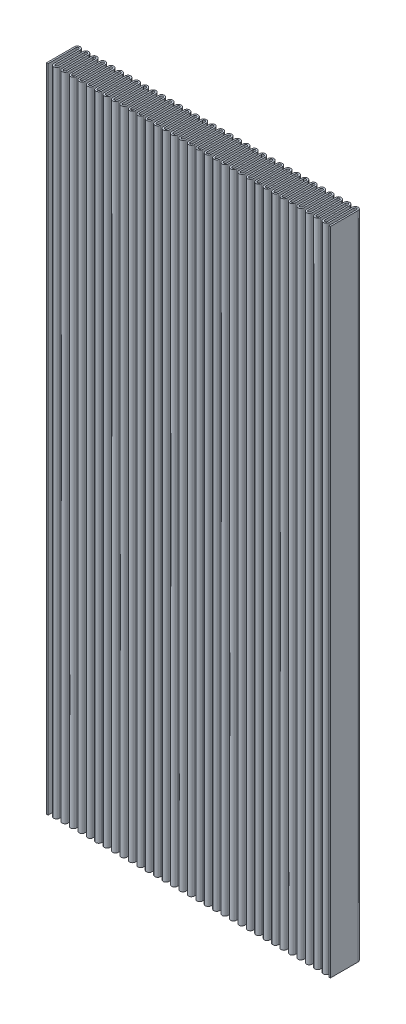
from build123d import *

# Parameters (mm, degrees)
BOSS_EXTRUDE1_DEPTH = 85


with BuildPart() as part:
    # Sketch1 → Boss-Extrude1 (new body)
    with BuildSketch(Plane(origin=(0, 0, 0), x_dir=(1, 0, 0), z_dir=(0, 1, 0))):
        with BuildLine():
            ThreePointArc((0, 3.8), (0.123743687, 3.748743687), (0.175, 3.625))
            Line((0.175, 3.625), (0.175, 0.375))
            ThreePointArc((0.175, 0.375), (0.284834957, 0.109834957), (0.55, 0))
            Line((0.55, 0), (0.55, 0.2))
            ThreePointArc((0.55, 0.2), (0.426256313, 0.251256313), (0.375, 0.375))
            Line((0.375, 0.375), (0.375, 3.625))
            ThreePointArc((0.375, 3.625), (0.265165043, 3.890165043), (0, 4))
            Line((0, 4), (0, 3.8))
        make_face()
        with BuildLine():
            ThreePointArc((-0.175, 3.625), (-0.123743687, 3.748743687), (0, 3.8))
            Line((0, 3.8), (0, 4))
            ThreePointArc((0, 4), (-0.265165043, 3.890165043), (-0.375, 3.625))
            Line((-0.375, 3.625), (-0.375, 0.375))
            Line((-0.375, 0.375), (-0.375, 0))
            Line((-0.375, 0), (-0.175, 0))
            Line((-0.175, 0), (-0.175, 0.375))
            Line((-0.175, 0.375), (-0.175, 3.625))
        make_face()
        with BuildLine():
            Line((0.55, 0.2), (0.55, 0))
            ThreePointArc((0.55, 0), (0.815165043, 0.109834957), (0.925, 0.375))
            Line((0.925, 0.375), (0.925, 3.625))
            ThreePointArc((0.925, 3.625), (0.976256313, 3.748743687), (1.1, 3.8))
            ThreePointArc((1.1, 3.8), (1.223743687, 3.748743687), (1.275, 3.625))
            Line((1.275, 3.625), (1.275, 0.375))
            ThreePointArc((1.275, 0.375), (1.65, 0), (2.025, 0.375))
            Line((2.025, 0.375), (2.025, 3.625))
            ThreePointArc((2.025, 3.625), (2.076256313, 3.748743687), (2.2, 3.8))
            ThreePointArc((2.2, 3.8), (2.323743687, 3.748743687), (2.375, 3.625))
            Line((2.375, 3.625), (2.375, 0.375))
            ThreePointArc((2.375, 0.375), (2.75, 0), (3.125, 0.375))
            Line((3.125, 0.375), (3.125, 3.625))
            ThreePointArc((3.125, 3.625), (3.176256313, 3.748743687), (3.3, 3.8))
            ThreePointArc((3.3, 3.8), (3.423743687, 3.748743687), (3.475, 3.625))
            Line((3.475, 3.625), (3.475, 0.375))
            ThreePointArc((3.475, 0.375), (3.85, 0), (4.225, 0.375))
            Line((4.225, 0.375), (4.225, 3.625))
            ThreePointArc((4.225, 3.625), (4.276256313, 3.748743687), (4.4, 3.8))
            ThreePointArc((4.4, 3.8), (4.523743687, 3.748743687), (4.575, 3.625))
            Line((4.575, 3.625), (4.575, 0.375))
            ThreePointArc((4.575, 0.375), (4.95, 0), (5.325, 0.375))
            Line((5.325, 0.375), (5.325, 3.625))
            ThreePointArc((5.325, 3.625), (5.376256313, 3.748743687), (5.5, 3.8))
            ThreePointArc((5.5, 3.8), (5.623743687, 3.748743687), (5.675, 3.625))
            Line((5.675, 3.625), (5.675, 0.375))
            ThreePointArc((5.675, 0.375), (6.05, 0), (6.425, 0.375))
            Line((6.425, 0.375), (6.425, 3.625))
            ThreePointArc((6.425, 3.625), (6.476256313, 3.748743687), (6.6, 3.8))
            ThreePointArc((6.6, 3.8), (6.723743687, 3.748743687), (6.775, 3.625))
            Line((6.775, 3.625), (6.775, 0.375))
            ThreePointArc((6.775, 0.375), (7.15, 0), (7.525, 0.375))
            Line((7.525, 0.375), (7.525, 3.625))
            ThreePointArc((7.525, 3.625), (7.576256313, 3.748743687), (7.7, 3.8))
            ThreePointArc((7.7, 3.8), (7.823743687, 3.748743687), (7.875, 3.625))
            Line((7.875, 3.625), (7.875, 0.375))
            ThreePointArc((7.875, 0.375), (8.25, 0), (8.625, 0.375))
            Line((8.625, 0.375), (8.625, 3.625))
            ThreePointArc((8.625, 3.625), (8.676256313, 3.748743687), (8.8, 3.8))
            ThreePointArc((8.8, 3.8), (8.923743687, 3.748743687), (8.975, 3.625))
            Line((8.975, 3.625), (8.975, 0.375))
            ThreePointArc((8.975, 0.375), (9.35, 0), (9.725, 0.375))
            Line((9.725, 0.375), (9.725, 3.625))
            ThreePointArc((9.725, 3.625), (9.776256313, 3.748743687), (9.9, 3.8))
            ThreePointArc((9.9, 3.8), (10.023743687, 3.748743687), (10.075, 3.625))
            Line((10.075, 3.625), (10.075, 0.375))
            ThreePointArc((10.075, 0.375), (10.45, 0), (10.825, 0.375))
            Line((10.825, 0.375), (10.825, 3.625))
            ThreePointArc((10.825, 3.625), (10.876256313, 3.748743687), (11, 3.8))
            ThreePointArc((11, 3.8), (11.123743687, 3.748743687), (11.175, 3.625))
            Line((11.175, 3.625), (11.175, 0.375))
            ThreePointArc((11.175, 0.375), (11.55, 0), (11.925, 0.375))
            Line((11.925, 0.375), (11.925, 3.625))
            ThreePointArc((11.925, 3.625), (11.976256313, 3.748743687), (12.1, 3.8))
            ThreePointArc((12.1, 3.8), (12.223743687, 3.748743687), (12.275, 3.625))
            Line((12.275, 3.625), (12.275, 0.375))
            ThreePointArc((12.275, 0.375), (12.65, 0), (13.025, 0.375))
            Line((13.025, 0.375), (13.025, 3.625))
            ThreePointArc((13.025, 3.625), (13.076256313, 3.748743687), (13.2, 3.8))
            ThreePointArc((13.2, 3.8), (13.323743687, 3.748743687), (13.375, 3.625))
            Line((13.375, 3.625), (13.375, 0.375))
            ThreePointArc((13.375, 0.375), (13.75, 0), (14.125, 0.375))
            Line((14.125, 0.375), (14.125, 3.625))
            ThreePointArc((14.125, 3.625), (14.176256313, 3.748743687), (14.3, 3.8))
            ThreePointArc((14.3, 3.8), (14.423743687, 3.748743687), (14.475, 3.625))
            Line((14.475, 3.625), (14.475, 0.375))
            ThreePointArc((14.475, 0.375), (14.85, 0), (15.225, 0.375))
            Line((15.225, 0.375), (15.225, 3.625))
            ThreePointArc((15.225, 3.625), (15.276256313, 3.748743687), (15.4, 3.8))
            ThreePointArc((15.4, 3.8), (15.523743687, 3.748743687), (15.575, 3.625))
            Line((15.575, 3.625), (15.575, 0.375))
            ThreePointArc((15.575, 0.375), (15.95, 0), (16.325, 0.375))
            Line((16.325, 0.375), (16.325, 3.625))
            ThreePointArc((16.325, 3.625), (16.376256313, 3.748743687), (16.5, 3.8))
            ThreePointArc((16.5, 3.8), (16.623743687, 3.748743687), (16.675, 3.625))
            Line((16.675, 3.625), (16.675, 0.375))
            ThreePointArc((16.675, 0.375), (17.05, 0), (17.425, 0.375))
            Line((17.425, 0.375), (17.425, 3.625))
            ThreePointArc((17.425, 3.625), (17.476256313, 3.748743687), (17.6, 3.8))
            ThreePointArc((17.6, 3.8), (17.723743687, 3.748743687), (17.775, 3.625))
            Line((17.775, 3.625), (17.775, 0.375))
            ThreePointArc((17.775, 0.375), (18.15, 0), (18.525, 0.375))
            Line((18.525, 0.375), (18.525, 3.625))
            ThreePointArc((18.525, 3.625), (18.576256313, 3.748743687), (18.7, 3.8))
            ThreePointArc((18.7, 3.8), (18.823743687, 3.748743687), (18.875, 3.625))
            Line((18.875, 3.625), (18.875, 0.375))
            ThreePointArc((18.875, 0.375), (19.25, 0), (19.625, 0.375))
            Line((19.625, 0.375), (19.625, 3.625))
            ThreePointArc((19.625, 3.625), (19.676256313, 3.748743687), (19.8, 3.8))
            ThreePointArc((19.8, 3.8), (19.923743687, 3.748743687), (19.975, 3.625))
            Line((19.975, 3.625), (19.975, 0.375))
            ThreePointArc((19.975, 0.375), (20.35, 0), (20.725, 0.375))
            Line((20.725, 0.375), (20.725, 3.625))
            ThreePointArc((20.725, 3.625), (20.776256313, 3.748743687), (20.9, 3.8))
            ThreePointArc((20.9, 3.8), (21.023743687, 3.748743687), (21.075, 3.625))
            Line((21.075, 3.625), (21.075, 0.375))
            ThreePointArc((21.075, 0.375), (21.45, 0), (21.825, 0.375))
            Line((21.825, 0.375), (21.825, 3.625))
            ThreePointArc((21.825, 3.625), (21.876256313, 3.748743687), (22, 3.8))
            ThreePointArc((22, 3.8), (22.123743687, 3.748743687), (22.175, 3.625))
            Line((22.175, 3.625), (22.175, 0.375))
            ThreePointArc((22.175, 0.375), (22.55, 0), (22.925, 0.375))
            Line((22.925, 0.375), (22.925, 3.625))
            ThreePointArc((22.925, 3.625), (22.976256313, 3.748743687), (23.1, 3.8))
            ThreePointArc((23.1, 3.8), (23.223743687, 3.748743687), (23.275, 3.625))
            Line((23.275, 3.625), (23.275, 0.375))
            ThreePointArc((23.275, 0.375), (23.65, 0), (24.025, 0.375))
            Line((24.025, 0.375), (24.025, 3.625))
            ThreePointArc((24.025, 3.625), (24.076256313, 3.748743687), (24.2, 3.8))
            ThreePointArc((24.2, 3.8), (24.323743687, 3.748743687), (24.375, 3.625))
            Line((24.375, 3.625), (24.375, 0.375))
            ThreePointArc((24.375, 0.375), (24.75, 0), (25.125, 0.375))
            Line((25.125, 0.375), (25.125, 3.625))
            ThreePointArc((25.125, 3.625), (25.176256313, 3.748743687), (25.3, 3.8))
            ThreePointArc((25.3, 3.8), (25.423743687, 3.748743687), (25.475, 3.625))
            Line((25.475, 3.625), (25.475, 0.375))
            ThreePointArc((25.475, 0.375), (25.85, 0), (26.225, 0.375))
            Line((26.225, 0.375), (26.225, 3.625))
            ThreePointArc((26.225, 3.625), (26.276256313, 3.748743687), (26.4, 3.8))
            ThreePointArc((26.4, 3.8), (26.523743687, 3.748743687), (26.575, 3.625))
            Line((26.575, 3.625), (26.575, 0.375))
            ThreePointArc((26.575, 0.375), (26.95, 0), (27.325, 0.375))
            Line((27.325, 0.375), (27.325, 3.625))
            ThreePointArc((27.325, 3.625), (27.376256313, 3.748743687), (27.5, 3.8))
            ThreePointArc((27.5, 3.8), (27.623743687, 3.748743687), (27.675, 3.625))
            Line((27.675, 3.625), (27.675, 0.375))
            ThreePointArc((27.675, 0.375), (28.05, 0), (28.425, 0.375))
            Line((28.425, 0.375), (28.425, 3.625))
            ThreePointArc((28.425, 3.625), (28.476256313, 3.748743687), (28.6, 3.8))
            ThreePointArc((28.6, 3.8), (28.723743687, 3.748743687), (28.775, 3.625))
            Line((28.775, 3.625), (28.775, 0.375))
            ThreePointArc((28.775, 0.375), (29.15, 0), (29.525, 0.375))
            Line((29.525, 0.375), (29.525, 3.625))
            ThreePointArc((29.525, 3.625), (29.576256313, 3.748743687), (29.7, 3.8))
            ThreePointArc((29.7, 3.8), (29.823743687, 3.748743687), (29.875, 3.625))
            Line((29.875, 3.625), (29.875, 0.375))
            ThreePointArc((29.875, 0.375), (30.25, 0), (30.625, 0.375))
            Line((30.625, 0.375), (30.625, 3.625))
            ThreePointArc((30.625, 3.625), (30.676256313, 3.748743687), (30.8, 3.8))
            ThreePointArc((30.8, 3.8), (30.923743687, 3.748743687), (30.975, 3.625))
            Line((30.975, 3.625), (30.975, 0.375))
            ThreePointArc((30.975, 0.375), (31.35, 0), (31.725, 0.375))
            Line((31.725, 0.375), (31.725, 3.625))
            ThreePointArc((31.725, 3.625), (31.776256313, 3.748743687), (31.9, 3.8))
            ThreePointArc((31.9, 3.8), (32.023743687, 3.748743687), (32.075, 3.625))
            Line((32.075, 3.625), (32.075, 0.375))
            ThreePointArc((32.075, 0.375), (32.45, 0), (32.825, 0.375))
            Line((32.825, 0.375), (32.825, 3.625))
            ThreePointArc((32.825, 3.625), (32.876256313, 3.748743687), (33, 3.8))
            ThreePointArc((33, 3.8), (33.123743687, 3.748743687), (33.175, 3.625))
            Line((33.175, 3.625), (33.175, 0.375))
            ThreePointArc((33.175, 0.375), (33.55, 0), (33.925, 0.375))
            Line((33.925, 0.375), (33.925, 3.625))
            ThreePointArc((33.925, 3.625), (33.976256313, 3.748743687), (34.1, 3.8))
            ThreePointArc((34.1, 3.8), (34.223743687, 3.748743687), (34.275, 3.625))
            Line((34.275, 3.625), (34.275, 0.375))
            ThreePointArc((34.275, 0.375), (34.65, 0), (35.025, 0.375))
            Line((35.025, 0.375), (35.025, 3.625))
            ThreePointArc((35.025, 3.625), (35.076256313, 3.748743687), (35.2, 3.8))
            ThreePointArc((35.2, 3.8), (35.323743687, 3.748743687), (35.375, 3.625))
            Line((35.375, 3.625), (35.375, 0.375))
            ThreePointArc((35.375, 0.375), (35.75, 0), (36.125, 0.375))
            Line((36.125, 0.375), (36.125, 3.625))
            ThreePointArc((36.125, 3.625), (36.176256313, 3.748743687), (36.3, 3.8))
            ThreePointArc((36.3, 3.8), (36.423743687, 3.748743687), (36.475, 3.625))
            Line((36.475, 3.625), (36.475, 0))
            Line((36.475, 0), (36.675, 0))
            Line((36.675, 0), (36.675, 3.625))
            ThreePointArc((36.675, 3.625), (36.565165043, 3.890165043), (36.3, 4))
            ThreePointArc((36.3, 4), (36.034834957, 3.890165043), (35.925, 3.625))
            Line((35.925, 3.625), (35.925, 0.375))
            ThreePointArc((35.925, 0.375), (35.75, 0.2), (35.575, 0.375))
            Line((35.575, 0.375), (35.575, 3.625))
            ThreePointArc((35.575, 3.625), (35.465165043, 3.890165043), (35.2, 4))
            ThreePointArc((35.2, 4), (34.934834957, 3.890165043), (34.825, 3.625))
            Line((34.825, 3.625), (34.825, 0.375))
            ThreePointArc((34.825, 0.375), (34.65, 0.2), (34.475, 0.375))
            Line((34.475, 0.375), (34.475, 3.625))
            ThreePointArc((34.475, 3.625), (34.365165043, 3.890165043), (34.1, 4))
            ThreePointArc((34.1, 4), (33.834834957, 3.890165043), (33.725, 3.625))
            Line((33.725, 3.625), (33.725, 0.375))
            ThreePointArc((33.725, 0.375), (33.55, 0.2), (33.375, 0.375))
            Line((33.375, 0.375), (33.375, 3.625))
            ThreePointArc((33.375, 3.625), (33.265165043, 3.890165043), (33, 4))
            ThreePointArc((33, 4), (32.734834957, 3.890165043), (32.625, 3.625))
            Line((32.625, 3.625), (32.625, 0.375))
            ThreePointArc((32.625, 0.375), (32.45, 0.2), (32.275, 0.375))
            Line((32.275, 0.375), (32.275, 3.625))
            ThreePointArc((32.275, 3.625), (32.165165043, 3.890165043), (31.9, 4))
            ThreePointArc((31.9, 4), (31.634834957, 3.890165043), (31.525, 3.625))
            Line((31.525, 3.625), (31.525, 0.375))
            ThreePointArc((31.525, 0.375), (31.35, 0.2), (31.175, 0.375))
            Line((31.175, 0.375), (31.175, 3.625))
            ThreePointArc((31.175, 3.625), (31.065165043, 3.890165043), (30.8, 4))
            ThreePointArc((30.8, 4), (30.534834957, 3.890165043), (30.425, 3.625))
            Line((30.425, 3.625), (30.425, 0.375))
            ThreePointArc((30.425, 0.375), (30.25, 0.2), (30.075, 0.375))
            Line((30.075, 0.375), (30.075, 3.625))
            ThreePointArc((30.075, 3.625), (29.965165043, 3.890165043), (29.7, 4))
            ThreePointArc((29.7, 4), (29.434834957, 3.890165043), (29.325, 3.625))
            Line((29.325, 3.625), (29.325, 0.375))
            ThreePointArc((29.325, 0.375), (29.15, 0.2), (28.975, 0.375))
            Line((28.975, 0.375), (28.975, 3.625))
            ThreePointArc((28.975, 3.625), (28.865165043, 3.890165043), (28.6, 4))
            ThreePointArc((28.6, 4), (28.334834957, 3.890165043), (28.225, 3.625))
            Line((28.225, 3.625), (28.225, 0.375))
            ThreePointArc((28.225, 0.375), (28.05, 0.2), (27.875, 0.375))
            Line((27.875, 0.375), (27.875, 3.625))
            ThreePointArc((27.875, 3.625), (27.765165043, 3.890165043), (27.5, 4))
            ThreePointArc((27.5, 4), (27.234834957, 3.890165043), (27.125, 3.625))
            Line((27.125, 3.625), (27.125, 0.375))
            ThreePointArc((27.125, 0.375), (26.95, 0.2), (26.775, 0.375))
            Line((26.775, 0.375), (26.775, 3.625))
            ThreePointArc((26.775, 3.625), (26.665165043, 3.890165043), (26.4, 4))
            ThreePointArc((26.4, 4), (26.134834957, 3.890165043), (26.025, 3.625))
            Line((26.025, 3.625), (26.025, 0.375))
            ThreePointArc((26.025, 0.375), (25.85, 0.2), (25.675, 0.375))
            Line((25.675, 0.375), (25.675, 3.625))
            ThreePointArc((25.675, 3.625), (25.565165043, 3.890165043), (25.3, 4))
            ThreePointArc((25.3, 4), (25.034834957, 3.890165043), (24.925, 3.625))
            Line((24.925, 3.625), (24.925, 0.375))
            ThreePointArc((24.925, 0.375), (24.75, 0.2), (24.575, 0.375))
            Line((24.575, 0.375), (24.575, 3.625))
            ThreePointArc((24.575, 3.625), (24.465165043, 3.890165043), (24.2, 4))
            ThreePointArc((24.2, 4), (23.934834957, 3.890165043), (23.825, 3.625))
            Line((23.825, 3.625), (23.825, 0.375))
            ThreePointArc((23.825, 0.375), (23.65, 0.2), (23.475, 0.375))
            Line((23.475, 0.375), (23.475, 3.625))
            ThreePointArc((23.475, 3.625), (23.365165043, 3.890165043), (23.1, 4))
            ThreePointArc((23.1, 4), (22.834834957, 3.890165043), (22.725, 3.625))
            Line((22.725, 3.625), (22.725, 0.375))
            ThreePointArc((22.725, 0.375), (22.55, 0.2), (22.375, 0.375))
            Line((22.375, 0.375), (22.375, 3.625))
            ThreePointArc((22.375, 3.625), (22.265165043, 3.890165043), (22, 4))
            ThreePointArc((22, 4), (21.734834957, 3.890165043), (21.625, 3.625))
            Line((21.625, 3.625), (21.625, 0.375))
            ThreePointArc((21.625, 0.375), (21.45, 0.2), (21.275, 0.375))
            Line((21.275, 0.375), (21.275, 3.625))
            ThreePointArc((21.275, 3.625), (21.165165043, 3.890165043), (20.9, 4))
            ThreePointArc((20.9, 4), (20.634834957, 3.890165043), (20.525, 3.625))
            Line((20.525, 3.625), (20.525, 0.375))
            ThreePointArc((20.525, 0.375), (20.35, 0.2), (20.175, 0.375))
            Line((20.175, 0.375), (20.175, 3.625))
            ThreePointArc((20.175, 3.625), (20.065165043, 3.890165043), (19.8, 4))
            ThreePointArc((19.8, 4), (19.534834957, 3.890165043), (19.425, 3.625))
            Line((19.425, 3.625), (19.425, 0.375))
            ThreePointArc((19.425, 0.375), (19.25, 0.2), (19.075, 0.375))
            Line((19.075, 0.375), (19.075, 3.625))
            ThreePointArc((19.075, 3.625), (18.965165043, 3.890165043), (18.7, 4))
            ThreePointArc((18.7, 4), (18.434834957, 3.890165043), (18.325, 3.625))
            Line((18.325, 3.625), (18.325, 0.375))
            ThreePointArc((18.325, 0.375), (18.15, 0.2), (17.975, 0.375))
            Line((17.975, 0.375), (17.975, 3.625))
            ThreePointArc((17.975, 3.625), (17.865165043, 3.890165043), (17.6, 4))
            ThreePointArc((17.6, 4), (17.334834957, 3.890165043), (17.225, 3.625))
            Line((17.225, 3.625), (17.225, 0.375))
            ThreePointArc((17.225, 0.375), (17.05, 0.2), (16.875, 0.375))
            Line((16.875, 0.375), (16.875, 3.625))
            ThreePointArc((16.875, 3.625), (16.765165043, 3.890165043), (16.5, 4))
            ThreePointArc((16.5, 4), (16.234834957, 3.890165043), (16.125, 3.625))
            Line((16.125, 3.625), (16.125, 0.375))
            ThreePointArc((16.125, 0.375), (15.95, 0.2), (15.775, 0.375))
            Line((15.775, 0.375), (15.775, 3.625))
            ThreePointArc((15.775, 3.625), (15.665165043, 3.890165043), (15.4, 4))
            ThreePointArc((15.4, 4), (15.134834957, 3.890165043), (15.025, 3.625))
            Line((15.025, 3.625), (15.025, 0.375))
            ThreePointArc((15.025, 0.375), (14.85, 0.2), (14.675, 0.375))
            Line((14.675, 0.375), (14.675, 3.625))
            ThreePointArc((14.675, 3.625), (14.565165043, 3.890165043), (14.3, 4))
            ThreePointArc((14.3, 4), (14.034834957, 3.890165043), (13.925, 3.625))
            Line((13.925, 3.625), (13.925, 0.375))
            ThreePointArc((13.925, 0.375), (13.75, 0.2), (13.575, 0.375))
            Line((13.575, 0.375), (13.575, 3.625))
            ThreePointArc((13.575, 3.625), (13.465165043, 3.890165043), (13.2, 4))
            ThreePointArc((13.2, 4), (12.934834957, 3.890165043), (12.825, 3.625))
            Line((12.825, 3.625), (12.825, 0.375))
            ThreePointArc((12.825, 0.375), (12.65, 0.2), (12.475, 0.375))
            Line((12.475, 0.375), (12.475, 3.625))
            ThreePointArc((12.475, 3.625), (12.365165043, 3.890165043), (12.1, 4))
            ThreePointArc((12.1, 4), (11.834834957, 3.890165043), (11.725, 3.625))
            Line((11.725, 3.625), (11.725, 0.375))
            ThreePointArc((11.725, 0.375), (11.55, 0.2), (11.375, 0.375))
            Line((11.375, 0.375), (11.375, 3.625))
            ThreePointArc((11.375, 3.625), (11.265165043, 3.890165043), (11, 4))
            ThreePointArc((11, 4), (10.734834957, 3.890165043), (10.625, 3.625))
            Line((10.625, 3.625), (10.625, 0.375))
            ThreePointArc((10.625, 0.375), (10.45, 0.2), (10.275, 0.375))
            Line((10.275, 0.375), (10.275, 3.625))
            ThreePointArc((10.275, 3.625), (10.165165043, 3.890165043), (9.9, 4))
            ThreePointArc((9.9, 4), (9.634834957, 3.890165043), (9.525, 3.625))
            Line((9.525, 3.625), (9.525, 0.375))
            ThreePointArc((9.525, 0.375), (9.35, 0.2), (9.175, 0.375))
            Line((9.175, 0.375), (9.175, 3.625))
            ThreePointArc((9.175, 3.625), (9.065165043, 3.890165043), (8.8, 4))
            ThreePointArc((8.8, 4), (8.534834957, 3.890165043), (8.425, 3.625))
            Line((8.425, 3.625), (8.425, 0.375))
            ThreePointArc((8.425, 0.375), (8.25, 0.2), (8.075, 0.375))
            Line((8.075, 0.375), (8.075, 3.625))
            ThreePointArc((8.075, 3.625), (7.965165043, 3.890165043), (7.7, 4))
            ThreePointArc((7.7, 4), (7.434834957, 3.890165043), (7.325, 3.625))
            Line((7.325, 3.625), (7.325, 0.375))
            ThreePointArc((7.325, 0.375), (7.15, 0.2), (6.975, 0.375))
            Line((6.975, 0.375), (6.975, 3.625))
            ThreePointArc((6.975, 3.625), (6.865165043, 3.890165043), (6.6, 4))
            ThreePointArc((6.6, 4), (6.334834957, 3.890165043), (6.225, 3.625))
            Line((6.225, 3.625), (6.225, 0.375))
            ThreePointArc((6.225, 0.375), (6.05, 0.2), (5.875, 0.375))
            Line((5.875, 0.375), (5.875, 3.625))
            ThreePointArc((5.875, 3.625), (5.765165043, 3.890165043), (5.5, 4))
            ThreePointArc((5.5, 4), (5.234834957, 3.890165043), (5.125, 3.625))
            Line((5.125, 3.625), (5.125, 0.375))
            ThreePointArc((5.125, 0.375), (4.95, 0.2), (4.775, 0.375))
            Line((4.775, 0.375), (4.775, 3.625))
            ThreePointArc((4.775, 3.625), (4.665165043, 3.890165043), (4.4, 4))
            ThreePointArc((4.4, 4), (4.134834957, 3.890165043), (4.025, 3.625))
            Line((4.025, 3.625), (4.025, 0.375))
            ThreePointArc((4.025, 0.375), (3.85, 0.2), (3.675, 0.375))
            Line((3.675, 0.375), (3.675, 3.625))
            ThreePointArc((3.675, 3.625), (3.565165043, 3.890165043), (3.3, 4))
            ThreePointArc((3.3, 4), (3.034834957, 3.890165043), (2.925, 3.625))
            Line((2.925, 3.625), (2.925, 0.375))
            ThreePointArc((2.925, 0.375), (2.75, 0.2), (2.575, 0.375))
            Line((2.575, 0.375), (2.575, 3.625))
            ThreePointArc((2.575, 3.625), (2.465165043, 3.890165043), (2.2, 4))
            ThreePointArc((2.2, 4), (1.934834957, 3.890165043), (1.825, 3.625))
            Line((1.825, 3.625), (1.825, 0.375))
            ThreePointArc((1.825, 0.375), (1.65, 0.2), (1.475, 0.375))
            Line((1.475, 0.375), (1.475, 3.625))
            ThreePointArc((1.475, 3.625), (1.365165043, 3.890165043), (1.1, 4))
            ThreePointArc((1.1, 4), (0.834834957, 3.890165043), (0.725, 3.625))
            Line((0.725, 3.625), (0.725, 0.375))
            ThreePointArc((0.725, 0.375), (0.673743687, 0.251256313), (0.55, 0.2))
        make_face()
    extrude(amount=BOSS_EXTRUDE1_DEPTH)


solid = part.part
